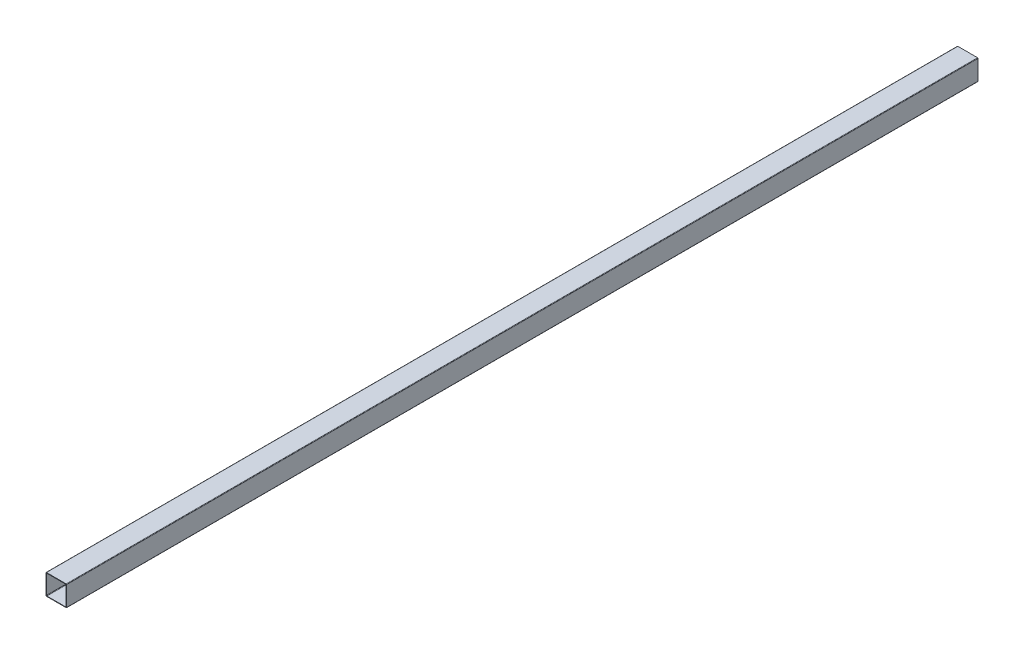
ISO-10303-21;
HEADER;
FILE_DESCRIPTION(('STEP AP214'),'2;1');
FILE_NAME('part.step','',(''),(''),'','','');
FILE_SCHEMA(('AUTOMOTIVE_DESIGN { 1 0 10303 214 1 1 1 1 }'));
ENDSEC;
DATA;
#1=APPLICATION_CONTEXT('core data for automotive mechanical design processes');
#2=APPLICATION_PROTOCOL_DEFINITION('international standard','automotive_design',2000,#1);
#3=PRODUCT_CONTEXT('',#1,'mechanical');
#4=PRODUCT('Part','Part','',(#3));
#5=PRODUCT_RELATED_PRODUCT_CATEGORY('part','',(#4));
#6=PRODUCT_DEFINITION_FORMATION('','',#4);
#7=PRODUCT_DEFINITION_CONTEXT('part definition',#1,'design');
#8=PRODUCT_DEFINITION('design','',#6,#7);
#9=PRODUCT_DEFINITION_SHAPE('','',#8);
#10=(LENGTH_UNIT() NAMED_UNIT(*) SI_UNIT(.MILLI.,.METRE.));
#11=(NAMED_UNIT(*) PLANE_ANGLE_UNIT() SI_UNIT($,.RADIAN.));
#12=(NAMED_UNIT(*) SI_UNIT($,.STERADIAN.) SOLID_ANGLE_UNIT());
#13=UNCERTAINTY_MEASURE_WITH_UNIT(LENGTH_MEASURE(1.E-05),#10,'distance_accuracy_value','');
#14=(GEOMETRIC_REPRESENTATION_CONTEXT(3) GLOBAL_UNCERTAINTY_ASSIGNED_CONTEXT((#13)) GLOBAL_UNIT_ASSIGNED_CONTEXT((#10,
#11,#12)) REPRESENTATION_CONTEXT('',''));
#15=CARTESIAN_POINT('',(0.,0.,0.));
#16=DIRECTION('',(0.,0.,1.));
#17=DIRECTION('',(1.,0.,0.));
#18=AXIS2_PLACEMENT_3D('',#15,#16,#17);
#19=CARTESIAN_POINT('',(-43.,-43.,3975.));
#20=DIRECTION('',(0.,0.,-1.));
#21=DIRECTION('',(-1.,0.,0.));
#22=AXIS2_PLACEMENT_3D('',#19,#20,#21);
#23=PLANE('',#22);
#24=CARTESIAN_POINT('',(-43.,-43.,3975.));
#25=DIRECTION('',(0.,0.,1.));
#26=DIRECTION('',(-1.,0.,0.));
#27=AXIS2_PLACEMENT_3D('',#24,#25,#26);
#28=CIRCLE('',#27,1.99999999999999);
#29=CARTESIAN_POINT('',(-45.,-43.,3975.));
#30=VERTEX_POINT('',#29);
#31=CARTESIAN_POINT('',(-43.,-45.,3975.));
#32=VERTEX_POINT('',#31);
#33=EDGE_CURVE('E211',#30,#32,#28,.T.);
#34=ORIENTED_EDGE('',*,*,#33,.T.);
#35=DIRECTION('',(1.,0.,0.));
#36=VECTOR('',#35,1.);
#37=CARTESIAN_POINT('',(43.,-45.,3975.));
#38=LINE('',#37,#36);
#39=CARTESIAN_POINT('',(43.,-45.,3975.));
#40=VERTEX_POINT('',#39);
#41=EDGE_CURVE('E214',#32,#40,#38,.T.);
#42=ORIENTED_EDGE('',*,*,#41,.T.);
#43=CARTESIAN_POINT('',(43.,-43.,3975.));
#44=DIRECTION('',(0.,0.,1.));
#45=DIRECTION('',(1.,0.,0.));
#46=AXIS2_PLACEMENT_3D('',#43,#44,#45);
#47=CIRCLE('',#46,2.);
#48=CARTESIAN_POINT('',(45.,-43.,3975.));
#49=VERTEX_POINT('',#48);
#50=EDGE_CURVE('E217',#40,#49,#47,.T.);
#51=ORIENTED_EDGE('',*,*,#50,.T.);
#52=DIRECTION('',(0.,1.,0.));
#53=VECTOR('',#52,1.);
#54=CARTESIAN_POINT('',(45.,-43.,3975.));
#55=LINE('',#54,#53);
#56=CARTESIAN_POINT('',(45.,43.,3975.));
#57=VERTEX_POINT('',#56);
#58=EDGE_CURVE('E219',#49,#57,#55,.T.);
#59=ORIENTED_EDGE('',*,*,#58,.T.);
#60=CARTESIAN_POINT('',(43.,43.,3975.));
#61=DIRECTION('',(0.,0.,1.));
#62=DIRECTION('',(1.,0.,0.));
#63=AXIS2_PLACEMENT_3D('',#60,#61,#62);
#64=CIRCLE('',#63,2.00000000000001);
#65=CARTESIAN_POINT('',(43.,45.,3975.));
#66=VERTEX_POINT('',#65);
#67=EDGE_CURVE('E221',#57,#66,#64,.T.);
#68=ORIENTED_EDGE('',*,*,#67,.T.);
#69=DIRECTION('',(-1.,0.,0.));
#70=VECTOR('',#69,1.);
#71=CARTESIAN_POINT('',(43.,45.,3975.));
#72=LINE('',#71,#70);
#73=CARTESIAN_POINT('',(-43.,45.,3975.));
#74=VERTEX_POINT('',#73);
#75=EDGE_CURVE('E223',#66,#74,#72,.T.);
#76=ORIENTED_EDGE('',*,*,#75,.T.);
#77=CARTESIAN_POINT('',(-43.,43.,3975.));
#78=DIRECTION('',(0.,0.,1.));
#79=DIRECTION('',(1.,0.,0.));
#80=AXIS2_PLACEMENT_3D('',#77,#78,#79);
#81=CIRCLE('',#80,2.00000000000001);
#82=CARTESIAN_POINT('',(-45.,43.,3975.));
#83=VERTEX_POINT('',#82);
#84=EDGE_CURVE('E225',#74,#83,#81,.T.);
#85=ORIENTED_EDGE('',*,*,#84,.T.);
#86=DIRECTION('',(0.,-1.,0.));
#87=VECTOR('',#86,1.);
#88=CARTESIAN_POINT('',(-45.,-43.,3975.));
#89=LINE('',#88,#87);
#90=EDGE_CURVE('E227',#83,#30,#89,.T.);
#91=ORIENTED_EDGE('',*,*,#90,.T.);
#92=EDGE_LOOP('',(#34,#42,#51,#59,#68,#76,#85,#91));
#93=FACE_BOUND('',#92,.T.);
#94=CARTESIAN_POINT('',(-41.,41.,3975.));
#95=DIRECTION('',(0.,0.,1.));
#96=DIRECTION('',(1.,0.,0.));
#97=AXIS2_PLACEMENT_3D('',#94,#95,#96);
#98=CIRCLE('',#97,2.00000000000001);
#99=CARTESIAN_POINT('',(-41.,43.,3975.));
#100=VERTEX_POINT('',#99);
#101=CARTESIAN_POINT('',(-43.,41.,3975.));
#102=VERTEX_POINT('',#101);
#103=EDGE_CURVE('E146',#100,#102,#98,.T.);
#104=ORIENTED_EDGE('',*,*,#103,.F.);
#105=DIRECTION('',(-1.,0.,0.));
#106=VECTOR('',#105,1.);
#107=CARTESIAN_POINT('',(41.,43.,3975.));
#108=LINE('',#107,#106);
#109=CARTESIAN_POINT('',(41.,43.,3975.));
#110=VERTEX_POINT('',#109);
#111=EDGE_CURVE('E179',#110,#100,#108,.T.);
#112=ORIENTED_EDGE('',*,*,#111,.F.);
#113=CARTESIAN_POINT('',(41.,41.,3975.));
#114=DIRECTION('',(0.,0.,1.));
#115=DIRECTION('',(1.,0.,0.));
#116=AXIS2_PLACEMENT_3D('',#113,#114,#115);
#117=CIRCLE('',#116,2.00000000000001);
#118=CARTESIAN_POINT('',(43.,41.,3975.));
#119=VERTEX_POINT('',#118);
#120=EDGE_CURVE('E177',#119,#110,#117,.T.);
#121=ORIENTED_EDGE('',*,*,#120,.F.);
#122=DIRECTION('',(0.,1.,0.));
#123=VECTOR('',#122,1.);
#124=CARTESIAN_POINT('',(43.,-41.,3975.));
#125=LINE('',#124,#123);
#126=CARTESIAN_POINT('',(43.,-41.,3975.));
#127=VERTEX_POINT('',#126);
#128=EDGE_CURVE('E175',#127,#119,#125,.T.);
#129=ORIENTED_EDGE('',*,*,#128,.F.);
#130=CARTESIAN_POINT('',(41.,-41.,3975.));
#131=DIRECTION('',(0.,0.,1.));
#132=DIRECTION('',(1.,0.,0.));
#133=AXIS2_PLACEMENT_3D('',#130,#131,#132);
#134=CIRCLE('',#133,2.);
#135=CARTESIAN_POINT('',(41.,-43.,3975.));
#136=VERTEX_POINT('',#135);
#137=EDGE_CURVE('E173',#136,#127,#134,.T.);
#138=ORIENTED_EDGE('',*,*,#137,.F.);
#139=DIRECTION('',(1.,0.,0.));
#140=VECTOR('',#139,1.);
#141=CARTESIAN_POINT('',(41.,-43.,3975.));
#142=LINE('',#141,#140);
#143=CARTESIAN_POINT('',(-41.,-43.,3975.));
#144=VERTEX_POINT('',#143);
#145=EDGE_CURVE('E169',#144,#136,#142,.T.);
#146=ORIENTED_EDGE('',*,*,#145,.F.);
#147=CARTESIAN_POINT('',(-41.,-41.,3975.));
#148=DIRECTION('',(0.,0.,1.));
#149=DIRECTION('',(-1.,0.,0.));
#150=AXIS2_PLACEMENT_3D('',#147,#148,#149);
#151=CIRCLE('',#150,1.99999999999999);
#152=CARTESIAN_POINT('',(-43.,-41.,3975.));
#153=VERTEX_POINT('',#152);
#154=EDGE_CURVE('E167',#153,#144,#151,.T.);
#155=ORIENTED_EDGE('',*,*,#154,.F.);
#156=DIRECTION('',(0.,-1.,0.));
#157=VECTOR('',#156,1.);
#158=CARTESIAN_POINT('',(-43.,-41.,3975.));
#159=LINE('',#158,#157);
#160=EDGE_CURVE('E154',#102,#153,#159,.T.);
#161=ORIENTED_EDGE('',*,*,#160,.F.);
#162=EDGE_LOOP('',(#104,#112,#121,#129,#138,#146,#155,#161));
#163=FACE_BOUND('',#162,.T.);
#164=ADVANCED_FACE('F33',(#93,#163),#23,.F.);
#165=CARTESIAN_POINT('',(-43.,-43.,0.));
#166=DIRECTION('',(0.,0.,-1.));
#167=DIRECTION('',(-1.,0.,0.));
#168=AXIS2_PLACEMENT_3D('',#165,#166,#167);
#169=PLANE('',#168);
#170=CARTESIAN_POINT('',(-43.,-43.,0.));
#171=DIRECTION('',(0.,0.,1.));
#172=DIRECTION('',(-1.,0.,0.));
#173=AXIS2_PLACEMENT_3D('',#170,#171,#172);
#174=CIRCLE('',#173,1.99999999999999);
#175=CARTESIAN_POINT('',(-45.,-43.,0.));
#176=VERTEX_POINT('',#175);
#177=CARTESIAN_POINT('',(-43.,-45.,0.));
#178=VERTEX_POINT('',#177);
#179=EDGE_CURVE('E162',#176,#178,#174,.T.);
#180=ORIENTED_EDGE('',*,*,#179,.F.);
#181=DIRECTION('',(0.,-1.,0.));
#182=VECTOR('',#181,1.);
#183=CARTESIAN_POINT('',(-45.,-43.,0.));
#184=LINE('',#183,#182);
#185=CARTESIAN_POINT('',(-45.,43.,0.));
#186=VERTEX_POINT('',#185);
#187=EDGE_CURVE('E215',#186,#176,#184,.T.);
#188=ORIENTED_EDGE('',*,*,#187,.F.);
#189=CARTESIAN_POINT('',(-43.,43.,0.));
#190=DIRECTION('',(0.,0.,1.));
#191=DIRECTION('',(1.,0.,0.));
#192=AXIS2_PLACEMENT_3D('',#189,#190,#191);
#193=CIRCLE('',#192,2.00000000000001);
#194=CARTESIAN_POINT('',(-43.,45.,0.));
#195=VERTEX_POINT('',#194);
#196=EDGE_CURVE('E242',#195,#186,#193,.T.);
#197=ORIENTED_EDGE('',*,*,#196,.F.);
#198=DIRECTION('',(-1.,0.,0.));
#199=VECTOR('',#198,1.);
#200=CARTESIAN_POINT('',(43.,45.,0.));
#201=LINE('',#200,#199);
#202=CARTESIAN_POINT('',(43.,45.,0.));
#203=VERTEX_POINT('',#202);
#204=EDGE_CURVE('E240',#203,#195,#201,.T.);
#205=ORIENTED_EDGE('',*,*,#204,.F.);
#206=CARTESIAN_POINT('',(43.,43.,0.));
#207=DIRECTION('',(0.,0.,1.));
#208=DIRECTION('',(1.,0.,0.));
#209=AXIS2_PLACEMENT_3D('',#206,#207,#208);
#210=CIRCLE('',#209,2.00000000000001);
#211=CARTESIAN_POINT('',(45.,43.,0.));
#212=VERTEX_POINT('',#211);
#213=EDGE_CURVE('E238',#212,#203,#210,.T.);
#214=ORIENTED_EDGE('',*,*,#213,.F.);
#215=DIRECTION('',(0.,1.,0.));
#216=VECTOR('',#215,1.);
#217=CARTESIAN_POINT('',(45.,-43.,0.));
#218=LINE('',#217,#216);
#219=CARTESIAN_POINT('',(45.,-43.,0.));
#220=VERTEX_POINT('',#219);
#221=EDGE_CURVE('E236',#220,#212,#218,.T.);
#222=ORIENTED_EDGE('',*,*,#221,.F.);
#223=CARTESIAN_POINT('',(43.,-43.,0.));
#224=DIRECTION('',(0.,0.,1.));
#225=DIRECTION('',(1.,0.,0.));
#226=AXIS2_PLACEMENT_3D('',#223,#224,#225);
#227=CIRCLE('',#226,2.);
#228=CARTESIAN_POINT('',(43.,-45.,0.));
#229=VERTEX_POINT('',#228);
#230=EDGE_CURVE('E234',#229,#220,#227,.T.);
#231=ORIENTED_EDGE('',*,*,#230,.F.);
#232=DIRECTION('',(1.,0.,0.));
#233=VECTOR('',#232,1.);
#234=CARTESIAN_POINT('',(43.,-45.,0.));
#235=LINE('',#234,#233);
#236=EDGE_CURVE('E232',#178,#229,#235,.T.);
#237=ORIENTED_EDGE('',*,*,#236,.F.);
#238=EDGE_LOOP('',(#180,#188,#197,#205,#214,#222,#231,#237));
#239=FACE_BOUND('',#238,.T.);
#240=DIRECTION('',(-1.,0.,0.));
#241=VECTOR('',#240,1.);
#242=CARTESIAN_POINT('',(41.,43.,0.));
#243=LINE('',#242,#241);
#244=CARTESIAN_POINT('',(41.,43.,0.));
#245=VERTEX_POINT('',#244);
#246=CARTESIAN_POINT('',(-41.,43.,0.));
#247=VERTEX_POINT('',#246);
#248=EDGE_CURVE('E155',#245,#247,#243,.T.);
#249=ORIENTED_EDGE('',*,*,#248,.T.);
#250=CARTESIAN_POINT('',(-41.,41.,0.));
#251=DIRECTION('',(0.,0.,1.));
#252=DIRECTION('',(1.,0.,0.));
#253=AXIS2_PLACEMENT_3D('',#250,#251,#252);
#254=CIRCLE('',#253,2.00000000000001);
#255=CARTESIAN_POINT('',(-43.,41.,0.));
#256=VERTEX_POINT('',#255);
#257=EDGE_CURVE('E56',#247,#256,#254,.T.);
#258=ORIENTED_EDGE('',*,*,#257,.T.);
#259=DIRECTION('',(0.,-1.,0.));
#260=VECTOR('',#259,1.);
#261=CARTESIAN_POINT('',(-43.,-41.,0.));
#262=LINE('',#261,#260);
#263=CARTESIAN_POINT('',(-43.,-41.,0.));
#264=VERTEX_POINT('',#263);
#265=EDGE_CURVE('E161',#256,#264,#262,.T.);
#266=ORIENTED_EDGE('',*,*,#265,.T.);
#267=CARTESIAN_POINT('',(-41.,-41.,0.));
#268=DIRECTION('',(0.,0.,1.));
#269=DIRECTION('',(-1.,0.,0.));
#270=AXIS2_PLACEMENT_3D('',#267,#268,#269);
#271=CIRCLE('',#270,1.99999999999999);
#272=CARTESIAN_POINT('',(-41.,-43.,0.));
#273=VERTEX_POINT('',#272);
#274=EDGE_CURVE('E183',#264,#273,#271,.T.);
#275=ORIENTED_EDGE('',*,*,#274,.T.);
#276=DIRECTION('',(1.,0.,0.));
#277=VECTOR('',#276,1.);
#278=CARTESIAN_POINT('',(41.,-43.,0.));
#279=LINE('',#278,#277);
#280=CARTESIAN_POINT('',(41.,-43.,0.));
#281=VERTEX_POINT('',#280);
#282=EDGE_CURVE('E186',#273,#281,#279,.T.);
#283=ORIENTED_EDGE('',*,*,#282,.T.);
#284=CARTESIAN_POINT('',(41.,-41.,0.));
#285=DIRECTION('',(0.,0.,1.));
#286=DIRECTION('',(1.,0.,0.));
#287=AXIS2_PLACEMENT_3D('',#284,#285,#286);
#288=CIRCLE('',#287,2.);
#289=CARTESIAN_POINT('',(43.,-41.,0.));
#290=VERTEX_POINT('',#289);
#291=EDGE_CURVE('E189',#281,#290,#288,.T.);
#292=ORIENTED_EDGE('',*,*,#291,.T.);
#293=DIRECTION('',(0.,1.,0.));
#294=VECTOR('',#293,1.);
#295=CARTESIAN_POINT('',(43.,-41.,0.));
#296=LINE('',#295,#294);
#297=CARTESIAN_POINT('',(43.,41.,0.));
#298=VERTEX_POINT('',#297);
#299=EDGE_CURVE('E192',#290,#298,#296,.T.);
#300=ORIENTED_EDGE('',*,*,#299,.T.);
#301=CARTESIAN_POINT('',(41.,41.,0.));
#302=DIRECTION('',(0.,0.,1.));
#303=DIRECTION('',(1.,0.,0.));
#304=AXIS2_PLACEMENT_3D('',#301,#302,#303);
#305=CIRCLE('',#304,2.00000000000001);
#306=EDGE_CURVE('E195',#298,#245,#305,.T.);
#307=ORIENTED_EDGE('',*,*,#306,.T.);
#308=EDGE_LOOP('',(#249,#258,#266,#275,#283,#292,#300,#307));
#309=FACE_BOUND('',#308,.T.);
#310=ADVANCED_FACE('F272',(#239,#309),#169,.T.);
#311=CARTESIAN_POINT('',(-43.,-43.,3975.));
#312=DIRECTION('',(0.,0.,-1.));
#313=DIRECTION('',(-1.,0.,0.));
#314=AXIS2_PLACEMENT_3D('',#311,#312,#313);
#315=CYLINDRICAL_SURFACE('',#314,1.99999999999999);
#316=ORIENTED_EDGE('',*,*,#179,.T.);
#317=DIRECTION('',(0.,0.,-1.));
#318=VECTOR('',#317,1.);
#319=CARTESIAN_POINT('',(-43.,-45.,3975.));
#320=LINE('',#319,#318);
#321=EDGE_CURVE('E11',#32,#178,#320,.T.);
#322=ORIENTED_EDGE('',*,*,#321,.F.);
#323=ORIENTED_EDGE('',*,*,#33,.F.);
#324=DIRECTION('',(0.,0.,-1.));
#325=VECTOR('',#324,1.);
#326=CARTESIAN_POINT('',(-45.,-43.,3975.));
#327=LINE('',#326,#325);
#328=EDGE_CURVE('E229',#30,#176,#327,.T.);
#329=ORIENTED_EDGE('',*,*,#328,.T.);
#330=EDGE_LOOP('',(#316,#322,#323,#329));
#331=FACE_BOUND('',#330,.T.);
#332=ADVANCED_FACE('F35',(#331),#315,.T.);
#333=CARTESIAN_POINT('',(43.,-45.,3975.));
#334=DIRECTION('',(0.,1.,0.));
#335=DIRECTION('',(-1.,0.,0.));
#336=AXIS2_PLACEMENT_3D('',#333,#334,#335);
#337=PLANE('',#336);
#338=ORIENTED_EDGE('',*,*,#236,.T.);
#339=DIRECTION('',(0.,0.,-1.));
#340=VECTOR('',#339,1.);
#341=CARTESIAN_POINT('',(43.,-45.,3975.));
#342=LINE('',#341,#340);
#343=EDGE_CURVE('E41',#40,#229,#342,.T.);
#344=ORIENTED_EDGE('',*,*,#343,.F.);
#345=ORIENTED_EDGE('',*,*,#41,.F.);
#346=ORIENTED_EDGE('',*,*,#321,.T.);
#347=EDGE_LOOP('',(#338,#344,#345,#346));
#348=FACE_BOUND('',#347,.T.);
#349=ADVANCED_FACE('F289',(#348),#337,.F.);
#350=CARTESIAN_POINT('',(43.,-43.,3975.));
#351=DIRECTION('',(0.,0.,-1.));
#352=DIRECTION('',(-1.,0.,0.));
#353=AXIS2_PLACEMENT_3D('',#350,#351,#352);
#354=CYLINDRICAL_SURFACE('',#353,2.);
#355=ORIENTED_EDGE('',*,*,#230,.T.);
#356=DIRECTION('',(0.,0.,-1.));
#357=VECTOR('',#356,1.);
#358=CARTESIAN_POINT('',(45.,-43.,3975.));
#359=LINE('',#358,#357);
#360=EDGE_CURVE('E259',#49,#220,#359,.T.);
#361=ORIENTED_EDGE('',*,*,#360,.F.);
#362=ORIENTED_EDGE('',*,*,#50,.F.);
#363=ORIENTED_EDGE('',*,*,#343,.T.);
#364=EDGE_LOOP('',(#355,#361,#362,#363));
#365=FACE_BOUND('',#364,.T.);
#366=ADVANCED_FACE('F266',(#365),#354,.T.);
#367=CARTESIAN_POINT('',(45.,-43.,3975.));
#368=DIRECTION('',(-1.,0.,0.));
#369=DIRECTION('',(0.,-1.,0.));
#370=AXIS2_PLACEMENT_3D('',#367,#368,#369);
#371=PLANE('',#370);
#372=ORIENTED_EDGE('',*,*,#221,.T.);
#373=DIRECTION('',(0.,0.,-1.));
#374=VECTOR('',#373,1.);
#375=CARTESIAN_POINT('',(45.,43.,3975.));
#376=LINE('',#375,#374);
#377=EDGE_CURVE('E256',#57,#212,#376,.T.);
#378=ORIENTED_EDGE('',*,*,#377,.F.);
#379=ORIENTED_EDGE('',*,*,#58,.F.);
#380=ORIENTED_EDGE('',*,*,#360,.T.);
#381=EDGE_LOOP('',(#372,#378,#379,#380));
#382=FACE_BOUND('',#381,.T.);
#383=ADVANCED_FACE('F278',(#382),#371,.F.);
#384=CARTESIAN_POINT('',(43.,43.,3975.));
#385=DIRECTION('',(0.,0.,-1.));
#386=DIRECTION('',(-1.,0.,0.));
#387=AXIS2_PLACEMENT_3D('',#384,#385,#386);
#388=CYLINDRICAL_SURFACE('',#387,2.00000000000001);
#389=ORIENTED_EDGE('',*,*,#213,.T.);
#390=DIRECTION('',(0.,0.,-1.));
#391=VECTOR('',#390,1.);
#392=CARTESIAN_POINT('',(43.,45.,3975.));
#393=LINE('',#392,#391);
#394=EDGE_CURVE('E253',#66,#203,#393,.T.);
#395=ORIENTED_EDGE('',*,*,#394,.F.);
#396=ORIENTED_EDGE('',*,*,#67,.F.);
#397=ORIENTED_EDGE('',*,*,#377,.T.);
#398=EDGE_LOOP('',(#389,#395,#396,#397));
#399=FACE_BOUND('',#398,.T.);
#400=ADVANCED_FACE('F282',(#399),#388,.T.);
#401=CARTESIAN_POINT('',(43.,45.,3975.));
#402=DIRECTION('',(0.,-1.,0.));
#403=DIRECTION('',(1.,0.,0.));
#404=AXIS2_PLACEMENT_3D('',#401,#402,#403);
#405=PLANE('',#404);
#406=ORIENTED_EDGE('',*,*,#204,.T.);
#407=DIRECTION('',(0.,0.,-1.));
#408=VECTOR('',#407,1.);
#409=CARTESIAN_POINT('',(-43.,45.,3975.));
#410=LINE('',#409,#408);
#411=EDGE_CURVE('E250',#74,#195,#410,.T.);
#412=ORIENTED_EDGE('',*,*,#411,.F.);
#413=ORIENTED_EDGE('',*,*,#75,.F.);
#414=ORIENTED_EDGE('',*,*,#394,.T.);
#415=EDGE_LOOP('',(#406,#412,#413,#414));
#416=FACE_BOUND('',#415,.T.);
#417=ADVANCED_FACE('F302',(#416),#405,.F.);
#418=CARTESIAN_POINT('',(-43.,43.,3975.));
#419=DIRECTION('',(0.,0.,-1.));
#420=DIRECTION('',(-1.,0.,0.));
#421=AXIS2_PLACEMENT_3D('',#418,#419,#420);
#422=CYLINDRICAL_SURFACE('',#421,2.00000000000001);
#423=ORIENTED_EDGE('',*,*,#196,.T.);
#424=DIRECTION('',(0.,0.,-1.));
#425=VECTOR('',#424,1.);
#426=CARTESIAN_POINT('',(-45.,43.,3975.));
#427=LINE('',#426,#425);
#428=EDGE_CURVE('E247',#83,#186,#427,.T.);
#429=ORIENTED_EDGE('',*,*,#428,.F.);
#430=ORIENTED_EDGE('',*,*,#84,.F.);
#431=ORIENTED_EDGE('',*,*,#411,.T.);
#432=EDGE_LOOP('',(#423,#429,#430,#431));
#433=FACE_BOUND('',#432,.T.);
#434=ADVANCED_FACE('F300',(#433),#422,.T.);
#435=CARTESIAN_POINT('',(-45.,-43.,3975.));
#436=DIRECTION('',(1.,0.,0.));
#437=DIRECTION('',(0.,1.,0.));
#438=AXIS2_PLACEMENT_3D('',#435,#436,#437);
#439=PLANE('',#438);
#440=ORIENTED_EDGE('',*,*,#187,.T.);
#441=ORIENTED_EDGE('',*,*,#328,.F.);
#442=ORIENTED_EDGE('',*,*,#90,.F.);
#443=ORIENTED_EDGE('',*,*,#428,.T.);
#444=EDGE_LOOP('',(#440,#441,#442,#443));
#445=FACE_BOUND('',#444,.T.);
#446=ADVANCED_FACE('F295',(#445),#439,.F.);
#447=CARTESIAN_POINT('',(-41.,41.,3975.));
#448=DIRECTION('',(0.,0.,-1.));
#449=DIRECTION('',(-1.,0.,0.));
#450=AXIS2_PLACEMENT_3D('',#447,#448,#449);
#451=CYLINDRICAL_SURFACE('',#450,2.00000000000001);
#452=ORIENTED_EDGE('',*,*,#257,.F.);
#453=DIRECTION('',(0.,0.,-1.));
#454=VECTOR('',#453,1.);
#455=CARTESIAN_POINT('',(-41.,43.,3975.));
#456=LINE('',#455,#454);
#457=EDGE_CURVE('E150',#100,#247,#456,.T.);
#458=ORIENTED_EDGE('',*,*,#457,.F.);
#459=ORIENTED_EDGE('',*,*,#103,.T.);
#460=DIRECTION('',(0.,0.,-1.));
#461=VECTOR('',#460,1.);
#462=CARTESIAN_POINT('',(-43.,41.,3975.));
#463=LINE('',#462,#461);
#464=EDGE_CURVE('E149',#102,#256,#463,.T.);
#465=ORIENTED_EDGE('',*,*,#464,.T.);
#466=EDGE_LOOP('',(#452,#458,#459,#465));
#467=FACE_BOUND('',#466,.T.);
#468=ADVANCED_FACE('F148',(#467),#451,.F.);
#469=CARTESIAN_POINT('',(-43.,-41.,3975.));
#470=DIRECTION('',(1.,0.,0.));
#471=DIRECTION('',(0.,1.,0.));
#472=AXIS2_PLACEMENT_3D('',#469,#470,#471);
#473=PLANE('',#472);
#474=ORIENTED_EDGE('',*,*,#265,.F.);
#475=ORIENTED_EDGE('',*,*,#464,.F.);
#476=ORIENTED_EDGE('',*,*,#160,.T.);
#477=DIRECTION('',(0.,0.,-1.));
#478=VECTOR('',#477,1.);
#479=CARTESIAN_POINT('',(-43.,-41.,3975.));
#480=LINE('',#479,#478);
#481=EDGE_CURVE('E163',#153,#264,#480,.T.);
#482=ORIENTED_EDGE('',*,*,#481,.T.);
#483=EDGE_LOOP('',(#474,#475,#476,#482));
#484=FACE_BOUND('',#483,.T.);
#485=ADVANCED_FACE('F158',(#484),#473,.T.);
#486=CARTESIAN_POINT('',(-41.,-41.,3975.));
#487=DIRECTION('',(0.,0.,-1.));
#488=DIRECTION('',(-1.,0.,0.));
#489=AXIS2_PLACEMENT_3D('',#486,#487,#488);
#490=CYLINDRICAL_SURFACE('',#489,1.99999999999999);
#491=ORIENTED_EDGE('',*,*,#274,.F.);
#492=ORIENTED_EDGE('',*,*,#481,.F.);
#493=ORIENTED_EDGE('',*,*,#154,.T.);
#494=DIRECTION('',(0.,0.,-1.));
#495=VECTOR('',#494,1.);
#496=CARTESIAN_POINT('',(-41.,-43.,3975.));
#497=LINE('',#496,#495);
#498=EDGE_CURVE('E208',#144,#273,#497,.T.);
#499=ORIENTED_EDGE('',*,*,#498,.T.);
#500=EDGE_LOOP('',(#491,#492,#493,#499));
#501=FACE_BOUND('',#500,.T.);
#502=ADVANCED_FACE('F327',(#501),#490,.F.);
#503=CARTESIAN_POINT('',(41.,-43.,3975.));
#504=DIRECTION('',(0.,1.,0.));
#505=DIRECTION('',(0.,0.,1.));
#506=AXIS2_PLACEMENT_3D('',#503,#504,#505);
#507=PLANE('',#506);
#508=ORIENTED_EDGE('',*,*,#282,.F.);
#509=ORIENTED_EDGE('',*,*,#498,.F.);
#510=ORIENTED_EDGE('',*,*,#145,.T.);
#511=DIRECTION('',(0.,0.,-1.));
#512=VECTOR('',#511,1.);
#513=CARTESIAN_POINT('',(41.,-43.,3975.));
#514=LINE('',#513,#512);
#515=EDGE_CURVE('E206',#136,#281,#514,.T.);
#516=ORIENTED_EDGE('',*,*,#515,.T.);
#517=EDGE_LOOP('',(#508,#509,#510,#516));
#518=FACE_BOUND('',#517,.T.);
#519=ADVANCED_FACE('F331',(#518),#507,.T.);
#520=CARTESIAN_POINT('',(41.,-41.,3975.));
#521=DIRECTION('',(0.,0.,-1.));
#522=DIRECTION('',(-1.,0.,0.));
#523=AXIS2_PLACEMENT_3D('',#520,#521,#522);
#524=CYLINDRICAL_SURFACE('',#523,2.);
#525=ORIENTED_EDGE('',*,*,#291,.F.);
#526=ORIENTED_EDGE('',*,*,#515,.F.);
#527=ORIENTED_EDGE('',*,*,#137,.T.);
#528=DIRECTION('',(0.,0.,-1.));
#529=VECTOR('',#528,1.);
#530=CARTESIAN_POINT('',(43.,-41.,3975.));
#531=LINE('',#530,#529);
#532=EDGE_CURVE('E204',#127,#290,#531,.T.);
#533=ORIENTED_EDGE('',*,*,#532,.T.);
#534=EDGE_LOOP('',(#525,#526,#527,#533));
#535=FACE_BOUND('',#534,.T.);
#536=ADVANCED_FACE('F337',(#535),#524,.F.);
#537=CARTESIAN_POINT('',(43.,-41.,3975.));
#538=DIRECTION('',(-1.,0.,0.));
#539=DIRECTION('',(0.,-1.,0.));
#540=AXIS2_PLACEMENT_3D('',#537,#538,#539);
#541=PLANE('',#540);
#542=ORIENTED_EDGE('',*,*,#299,.F.);
#543=ORIENTED_EDGE('',*,*,#532,.F.);
#544=ORIENTED_EDGE('',*,*,#128,.T.);
#545=DIRECTION('',(0.,0.,-1.));
#546=VECTOR('',#545,1.);
#547=CARTESIAN_POINT('',(43.,41.,3975.));
#548=LINE('',#547,#546);
#549=EDGE_CURVE('E202',#119,#298,#548,.T.);
#550=ORIENTED_EDGE('',*,*,#549,.T.);
#551=EDGE_LOOP('',(#542,#543,#544,#550));
#552=FACE_BOUND('',#551,.T.);
#553=ADVANCED_FACE('F341',(#552),#541,.T.);
#554=CARTESIAN_POINT('',(41.,41.,3975.));
#555=DIRECTION('',(0.,0.,-1.));
#556=DIRECTION('',(-1.,0.,0.));
#557=AXIS2_PLACEMENT_3D('',#554,#555,#556);
#558=CYLINDRICAL_SURFACE('',#557,2.00000000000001);
#559=ORIENTED_EDGE('',*,*,#306,.F.);
#560=ORIENTED_EDGE('',*,*,#549,.F.);
#561=ORIENTED_EDGE('',*,*,#120,.T.);
#562=DIRECTION('',(0.,0.,-1.));
#563=VECTOR('',#562,1.);
#564=CARTESIAN_POINT('',(41.,43.,3975.));
#565=LINE('',#564,#563);
#566=EDGE_CURVE('E48',#110,#245,#565,.T.);
#567=ORIENTED_EDGE('',*,*,#566,.T.);
#568=EDGE_LOOP('',(#559,#560,#561,#567));
#569=FACE_BOUND('',#568,.T.);
#570=ADVANCED_FACE('F345',(#569),#558,.F.);
#571=CARTESIAN_POINT('',(41.,43.,3975.));
#572=DIRECTION('',(0.,-1.,0.));
#573=DIRECTION('',(0.,0.,-1.));
#574=AXIS2_PLACEMENT_3D('',#571,#572,#573);
#575=PLANE('',#574);
#576=ORIENTED_EDGE('',*,*,#248,.F.);
#577=ORIENTED_EDGE('',*,*,#566,.F.);
#578=ORIENTED_EDGE('',*,*,#111,.T.);
#579=ORIENTED_EDGE('',*,*,#457,.T.);
#580=EDGE_LOOP('',(#576,#577,#578,#579));
#581=FACE_BOUND('',#580,.T.);
#582=ADVANCED_FACE('F349',(#581),#575,.T.);
#583=CLOSED_SHELL('',(#164,#310,#332,#349,#366,#383,#400,#417,#434,#446,#468,#485,#502,#519,
#536,#553,#570,#582));
#584=MANIFOLD_SOLID_BREP('B2',#583);
#585=ADVANCED_BREP_SHAPE_REPRESENTATION('',(#18,#584),#14);
#586=SHAPE_DEFINITION_REPRESENTATION(#9,#585);
ENDSEC;
END-ISO-10303-21;
